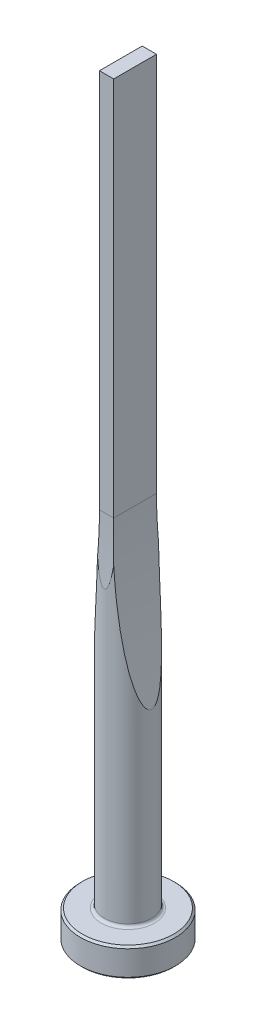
from build123d import *

# Parameters (mm, degrees)
CUT_EXTRUDE1_DEPTH = 5
CUT_EXTRUDE2_DEPTH = 5


with BuildPart() as part:
    # Sketch1 → Revolve1 (revolve)
    with BuildSketch(Plane.XY, mode=Mode.PRIVATE) as revolve1_sk:
        with BuildLine():
            Line((0, 0), (4.8, 0))
            Line((4.8, 0), (5, 0.2))
            Line((5, 0.2), (5, 2.8))
            Line((5, 2.8), (4.8, 3))
            Line((4.8, 3), (2.8, 3))
            ThreePointArc((2.8, 3), (2.587867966, 3.087867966), (2.5, 3.3))
            Line((2.5, 3.3), (2.5, 80))
            Line((2.5, 80), (0, 80))
            Line((0, 80), (0, 0))
        make_face()
    revolve(revolve1_sk.sketch.rotate(Axis((0, 80, 0), (0, -1, 0)), 180), axis=Axis((0, 80, 0), (0, -1, 0)))

    # Sketch2 → Cut-Extrude1 (cut, symmetric)
    with BuildSketch(Plane.XY):
        with BuildLine():
            Line((0.75, 80), (0.75, 40))
            ThreePointArc((0.75, 40), (1.188568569, 31.125880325), (2.5, 22.338247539))
            Line((2.5, 22.338247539), (2.5, 80))
            Line((2.5, 80), (0.75, 80))
        make_face()
        with BuildLine():
            Line((-0.75, 80), (-0.75, 40))
            ThreePointArc((-0.75, 40), (-1.188568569, 31.125880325), (-2.5, 22.338247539))
            Line((-2.5, 22.338247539), (-2.5, 80))
            Line((-2.5, 80), (-0.75, 80))
        make_face()
    extrude(amount=CUT_EXTRUDE1_DEPTH, both=True, mode=Mode.SUBTRACT)

    # Sketch3 → Cut-Extrude2 (cut, symmetric)
    with BuildSketch(Plane(origin=(0, 0, 0), x_dir=(0, 0, -1), z_dir=(1, 0, 0))):
        with BuildLine():
            Line((2.25, 80), (2.25, 40))
            ThreePointArc((2.25, 40), (2.312521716, 36.645898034), (2.5, 33.296456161))
            Line((2.5, 33.296456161), (2.5, 80))
            Line((2.5, 80), (2.25, 80))
        make_face()
        with BuildLine():
            Line((-2.25, 80), (-2.25, 40))
            ThreePointArc((-2.25, 40), (-2.312521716, 36.645898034), (-2.5, 33.296456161))
            Line((-2.5, 33.296456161), (-2.5, 80))
            Line((-2.5, 80), (-2.25, 80))
        make_face()
    extrude(amount=CUT_EXTRUDE2_DEPTH, both=True, mode=Mode.SUBTRACT)


solid = part.part
